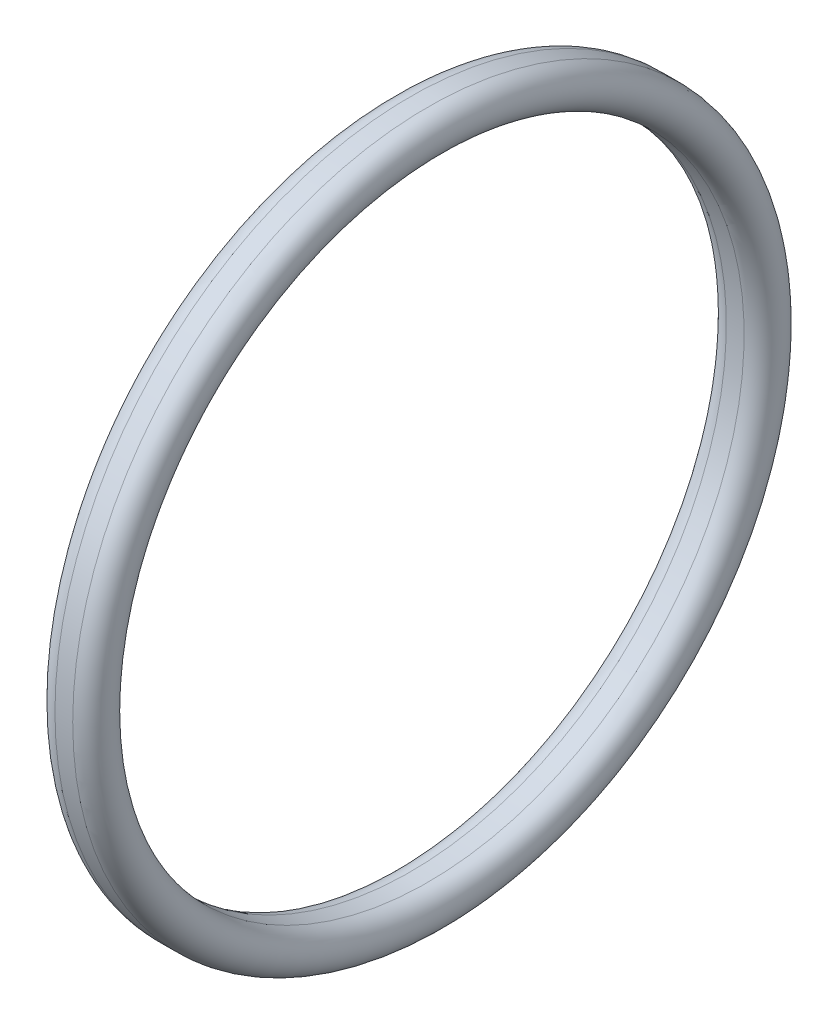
from build123d import *


with BuildPart() as part:
    # Sketch1 → Revolve1 (revolve)
    with BuildSketch(Plane.XY, mode=Mode.PRIVATE) as revolve1_sk:
        with BuildLine():
            Line((-0.635, 25.3746), (0.635, 25.3746))
            ThreePointArc((0.635, 25.3746), (2.02565, 23.98395), (0.635, 22.5933))
            Line((0.635, 22.5933), (-0.635, 22.5933))
            ThreePointArc((-0.635, 22.5933), (-2.02565, 23.98395), (-0.635, 25.3746))
        make_face()
    revolve(revolve1_sk.sketch.rotate(Axis((0, 0, 0), (1, 0, 0)), 90), axis=Axis((0, 0, 0), (1, 0, 0)))


solid = part.part
